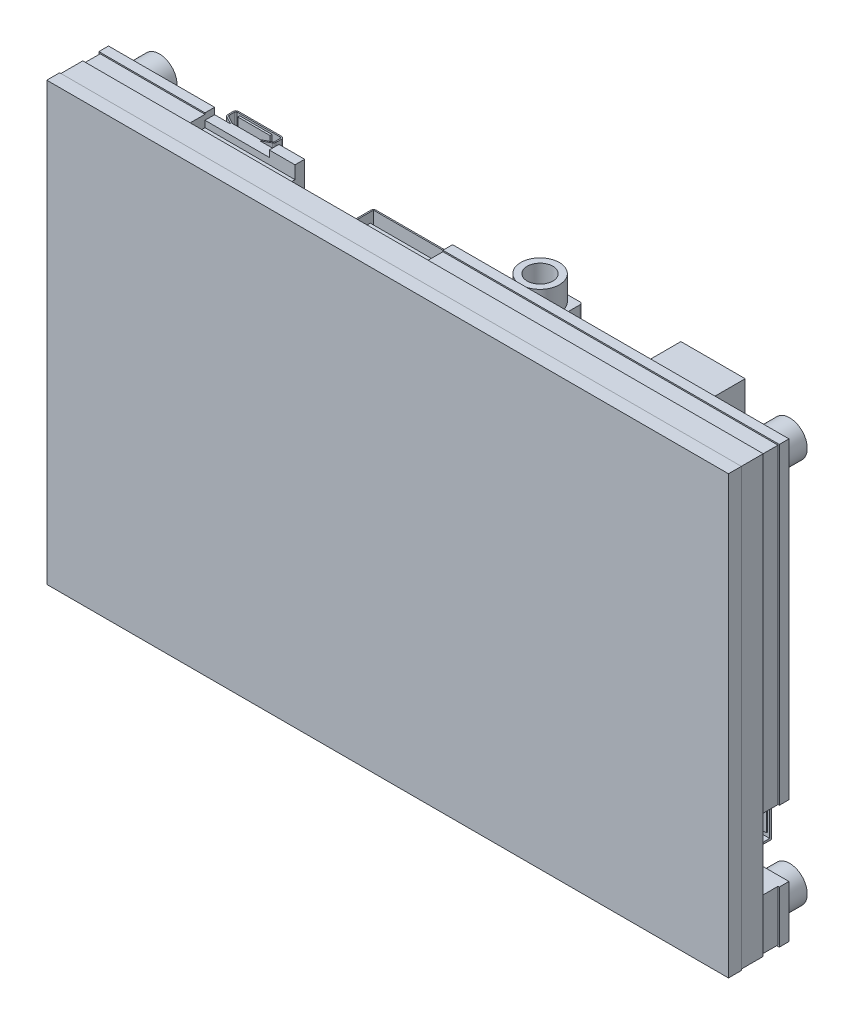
from build123d import *

# Parameters (mm, degrees)
ESQUISSE1_W                = 106
ESQUISSE1_H                = 67.9
BOSS_EXTRU_1_DEPTH         = 2
ESQUISSE2_W                = 105.8
ESQUISSE2_H                = 67.7
BOSS_EXTRU_2_DEPTH         = 3.5
ESQUISSE5_W                = 105.4
ESQUISSE5_H                = 67.3
BOSS_EXTRU_3_DEPTH         = 2.5
BOSS_EXTRU_4_DEPTH         = 1.5
ESQUISSE7_W                = 5.3
ESQUISSE7_H                = 11
ENL_V_MAT_EXTRU_1_DEPTH    = 2.5
ESQUISSE8_R                = 2.75
ESQUISSE8_R_2              = 1.25
BOSS_EXTRU_5_DEPTH         = 4
ESQUISSE9_W                = 10
ESQUISSE9_H                = 5
ESQUISSE9_W_2              = 9.4
ESQUISSE9_H_2              = 4.4
ESQUISSE9_W_3              = 7
ESQUISSE9_H_3              = 12.5
ESQUISSE9_W_4              = 15
ESQUISSE9_H_4              = 11.5
BOSS_EXTRU_6_DEPTH         = 6.2
CONG_1_R                   = 0.4
ESQUISSE10_R               = 3
ESQUISSE10_R_2             = 2
BOSS_EXTRU_7_DEPTH         = 3.8
ESQUISSE11_W               = 11.6
ESQUISSE11_H               = 1
ENL_V_MAT_EXTRU_2_DEPTH    = 7
ESQUISSE12_W               = 3
ESQUISSE12_H               = 7
BOSS_EXTRU_8_DEPTH         = 3.5
R_P_TITION_LIN_AIRE1_COUNT = 5
R_P_TITION_LIN_AIRE1_PITCH = 11.7
BOSS_EXTRU_9_DEPTH         = 5.5
CONG_2_R                   = 0.4
ESQUISSE15_W               = 5
ESQUISSE15_H               = 0.3
ENL_V_MAT_EXTRU_3_DEPTH    = 4
BOSS_EXTRU_10_DEPTH        = 0.5
BOSS_EXTRU_10_DEPTH_BACK   = 5
ESQUISSE17_W               = 0.2
ESQUISSE17_H               = 5
ENL_V_MAT_EXTRU_4_DEPTH    = 4


with BuildPart() as part:
    # Esquisse1 → Boss.-Extru.1 (new body)
    with BuildSketch(Plane.XY):
        Rectangle(ESQUISSE1_W, ESQUISSE1_H)
    extrude(amount=BOSS_EXTRU_1_DEPTH)

    # Esquisse2 → Boss.-Extru.2 (add)
    with BuildSketch(Plane(origin=(0, 0, 0), x_dir=(-1, 0, 0), z_dir=(0, 0, -1))):
        Rectangle(ESQUISSE2_W, ESQUISSE2_H)
    extrude(amount=BOSS_EXTRU_2_DEPTH)

    # Esquisse5 → Boss.-Extru.3 (add)
    with BuildSketch(Plane(origin=(0, 0, -3.5), x_dir=(-1, 0, 0), z_dir=(0, 0, -1))):
        Rectangle(ESQUISSE5_W, ESQUISSE5_H)
    extrude(amount=BOSS_EXTRU_3_DEPTH)

    # Esquisse6 → Boss.-Extru.4 (add)
    with BuildSketch(Plane(origin=(0, 0, -6), x_dir=(-1, 0, 0), z_dir=(0, 0, -1))):
        Polygon((-0.6, 33.85), (-52.9, 33.85), (-52.9, -14.75), (-47.4, -14.75), (-47.4, -25.75), (-52.9, -25.75), (-52.9, -33.85), (52.9, -33.85), (52.9, 33.85), (36.4, 33.85), (36.4, 32.85), (26.4, 32.85), (26.4, 33.85), (22.4, 33.85), (22.4, 25.85), (-0.6, 25.85), align=None)
    extrude(amount=BOSS_EXTRU_4_DEPTH)

    # Esquisse7 → Enl_v. mat.-Extru.1 (cut)
    with BuildSketch(Plane(origin=(0, 0, -6), x_dir=(-1, 0, 0), z_dir=(0, 0, -1))):
        with Locations((-50.05, -20.25)):
            Rectangle(ESQUISSE7_W, ESQUISSE7_H)
        Polygon((-0.6, 33.65), (-0.6, 25.85), (22.4, 25.85), (22.4, 31.85), (36.4, 31.85), (36.4, 33.65), align=None)
    extrude(amount=-ENL_V_MAT_EXTRU_1_DEPTH, mode=Mode.SUBTRACT)

    # Esquisse8 → Boss.-Extru.5 (add)
    # profile 1 of 8: a face of its own
    with BuildSketch(Plane(origin=(0, 0, -7.5), x_dir=(-1, 0, 0), z_dir=(0, 0, -1))):
        with Locations((-49, 30)):
            Circle(ESQUISSE8_R)
        with Locations((-49, 30)):
            Circle(ESQUISSE8_R_2, mode=Mode.SUBTRACT)
    # profile 2 of 8: a face of its own
    with BuildSketch(Plane(origin=(0, 0, -7.5), x_dir=(-1, 0, 0), z_dir=(0, 0, -1))):
        with Locations((49, 30)):
            Circle(ESQUISSE8_R)
        with Locations((49, 30)):
            Circle(ESQUISSE8_R_2, mode=Mode.SUBTRACT)
    # profile 3 of 8: a face of its own
    with BuildSketch(Plane(origin=(0, 0, -7.5), x_dir=(-1, 0, 0), z_dir=(0, 0, -1))):
        with Locations((38.8, 22.9)):
            Circle(ESQUISSE8_R)
        with Locations((38.8, 22.9)):
            Circle(ESQUISSE8_R_2, mode=Mode.SUBTRACT)
    # profile 4 of 8: a face of its own
    with BuildSketch(Plane(origin=(0, 0, -7.5), x_dir=(-1, 0, 0), z_dir=(0, 0, -1))):
        with Locations((-19.2, 22.9)):
            Circle(ESQUISSE8_R)
        with Locations((-19.2, 22.9)):
            Circle(ESQUISSE8_R_2, mode=Mode.SUBTRACT)
    # profile 5 of 8: a face of its own
    with BuildSketch(Plane(origin=(0, 0, -7.5), x_dir=(-1, 0, 0), z_dir=(0, 0, -1))):
        with Locations((-49, -30)):
            Circle(ESQUISSE8_R)
        with Locations((-49, -30)):
            Circle(ESQUISSE8_R_2, mode=Mode.SUBTRACT)
    # profile 6 of 8: a face of its own
    with BuildSketch(Plane(origin=(0, 0, -7.5), x_dir=(-1, 0, 0), z_dir=(0, 0, -1))):
        with Locations((-19.2, -27.1)):
            Circle(ESQUISSE8_R)
        with Locations((-19.2, -27.1)):
            Circle(ESQUISSE8_R_2, mode=Mode.SUBTRACT)
    # profile 7 of 8: a face of its own
    with BuildSketch(Plane(origin=(0, 0, -7.5), x_dir=(-1, 0, 0), z_dir=(0, 0, -1))):
        with Locations((38.8, -27.1)):
            Circle(ESQUISSE8_R)
        with Locations((38.8, -27.1)):
            Circle(ESQUISSE8_R_2, mode=Mode.SUBTRACT)
    # profile 8 of 8: a face of its own
    with BuildSketch(Plane(origin=(0, 0, -7.5), x_dir=(-1, 0, 0), z_dir=(0, 0, -1))):
        with Locations((49, -30)):
            Circle(ESQUISSE8_R)
        with Locations((49, -30)):
            Circle(ESQUISSE8_R_2, mode=Mode.SUBTRACT)
    extrude(amount=BOSS_EXTRU_5_DEPTH)

    # Esquisse9 → Boss.-Extru.6 (add)
    # profile 1 of 3: a face of its own
    with BuildSketch(Plane(origin=(0, 0, -7.5), x_dir=(-1, 0, 0), z_dir=(0, 0, -1))):
        with Locations((-34.9, 29.85)):
            Rectangle(ESQUISSE9_W, ESQUISSE9_H)
        with Locations((-34.9, 29.85)):
            Rectangle(ESQUISSE9_W_2, ESQUISSE9_H_2, mode=Mode.SUBTRACT)
    # profile 2 of 3: a face of its own
    with BuildSketch(Plane(origin=(0, 0, -7.5), x_dir=(-1, 0, 0), z_dir=(0, 0, -1))):
        with Locations((-11.1, 23.6)):
            Rectangle(ESQUISSE9_W_3, ESQUISSE9_H_3)
    # profile 3 of 3: a face of its own
    with BuildSketch(Plane(origin=(0, 0, -7.5), x_dir=(-1, 0, 0), z_dir=(0, 0, -1))):
        with Locations((10.4, 20.6)):
            Rectangle(ESQUISSE9_W_4, ESQUISSE9_H_4)
    extrude(amount=BOSS_EXTRU_6_DEPTH)

    # Cong_1
    cong_1_edges = [part.edges().sort_by_distance(p)[0] for p in [
        (14.6, 23.6, -13.7),
        (7.6, 23.6, -13.7),
        (-2.9, 20.6, -13.7),
        (-17.9, 20.6, -13.7),
    ]]
    fillet(cong_1_edges, radius=CONG_1_R)

    # Esquisse10 → Boss.-Extru.7 (add)
    with BuildSketch(Plane(origin=(0, 29.85, 0), x_dir=(1, 0, 0), z_dir=(0, 1, 0))):
        with Locations(Location((11.1, 10.6, 0), (0, 0, 90))):
            Circle(ESQUISSE10_R)
        with Locations(Location((11.1, 10.6, 0), (0, 0, 90))):
            Circle(ESQUISSE10_R_2, mode=Mode.SUBTRACT)
    extrude(amount=BOSS_EXTRU_7_DEPTH)

    # Esquisse11 → Enl_v. mat.-Extru.2 (cut)
    with BuildSketch(Plane(origin=(0, 26.35, 0), x_dir=(1, 0, 0), z_dir=(0, 1, 0))):
        Polygon((-17.7, 13.5), (-3.1, 13.5), (-3.1, 11), (-5.4, 7.8), (-15.4, 7.8), (-17.7, 11), align=None)
        with Locations((-10.4, 11)):
            Rectangle(ESQUISSE11_W, ESQUISSE11_H, mode=Mode.SUBTRACT)
    extrude(amount=-ENL_V_MAT_EXTRU_2_DEPTH, mode=Mode.SUBTRACT)

    # Esquisse12 → Boss.-Extru.8 (add)
    with BuildSketch(Plane(origin=(0, 0, -7.5), x_dir=(-1, 0, 0), z_dir=(0, 0, -1))):
        with Locations((49.4, 23.35)):
            Rectangle(ESQUISSE12_W, ESQUISSE12_H)
    boss_extru_8 = extrude(amount=BOSS_EXTRU_8_DEPTH)

    # R_p_tition lin_aire1: Boss.-Extru.8 ×5
    with Locations(*[(0, -i * R_P_TITION_LIN_AIRE1_PITCH, 0) for i in range(1, R_P_TITION_LIN_AIRE1_COUNT)]):
        add(boss_extru_8)

    # Esquisse13 → Boss.-Extru.9 (add)
    with BuildSketch(Plane(origin=(0, 32.85, 0), x_dir=(1, 0, 0), z_dir=(0, 1, 0))):
        Polygon((-35.4, 9.8), (-27.9, 9.8), (-27.9, 8.3), (-29.4, 7.5), (-33.9, 7.5), (-35.4, 8.3), align=None)
    extrude(amount=-BOSS_EXTRU_9_DEPTH)

    # Cong_2
    cong_2_edges = [part.edges().sort_by_distance(p)[0] for p in [
        (-35.4, 30.1, -8.3),
        (-35.4, 30.1, -9.8),
        (-27.9, 30.1, -9.8),
        (-27.9, 30.1, -8.3),
    ]]
    fillet(cong_2_edges, radius=CONG_2_R)

    # Esquisse15 → Enl_v. mat.-Extru.3 (cut)
    with BuildSketch(Plane(origin=(0, 32.85, 0), x_dir=(1, 0, 0), z_dir=(0, 1, 0))):
        with BuildLine():
            Line((-33.85, 7.7), (-29.45, 7.7))
            Line((-29.45, 7.7), (-28.205882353, 8.363529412))
            ThreePointArc((-28.205882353, 8.363529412), (-28.128501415, 8.437100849), (-28.1, 8.54))
            Line((-28.1, 8.54), (-28.1, 9.4))
            ThreePointArc((-28.1, 9.4), (-28.158578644, 9.541421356), (-28.3, 9.6))
            Line((-28.3, 9.6), (-35, 9.6))
            ThreePointArc((-35, 9.6), (-35.141421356, 9.541421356), (-35.2, 9.4))
            Line((-35.2, 9.4), (-35.2, 8.54))
            ThreePointArc((-35.2, 8.54), (-35.171498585, 8.437100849), (-35.094117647, 8.363529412))
            Line((-35.094117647, 8.363529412), (-33.85, 7.7))
        make_face()
        with Locations((-31.8, 9.15)):
            Rectangle(ESQUISSE15_W, ESQUISSE15_H, mode=Mode.SUBTRACT)
    extrude(amount=-ENL_V_MAT_EXTRU_3_DEPTH, mode=Mode.SUBTRACT)

    # Esquisse16 → Boss.-Extru.10 (add, two sides: drawn at the far end of the back side and taken through both)
    with BuildSketch(Plane(origin=(47.4, 0, 0), x_dir=(0, 0, -1), z_dir=(1, 0, 0)).offset(-BOSS_EXTRU_10_DEPTH_BACK)):
        Polygon((9.8, -16.25), (9.8, -23.75), (8.3, -23.75), (7.5, -22.25), (7.5, -17.75), (8.3, -16.25), align=None)
    extrude(amount=BOSS_EXTRU_10_DEPTH + BOSS_EXTRU_10_DEPTH_BACK)

    # Esquisse17 → Enl_v. mat.-Extru.4 (cut)
    with BuildSketch(Plane(origin=(47.9, 0, 0), x_dir=(0, 0, -1), z_dir=(1, 0, 0))):
        Polygon((9.5, -16.55), (8.48, -16.55), (7.8, -17.825), (7.8, -22.175), (8.48, -23.45), (9.5, -23.45), align=None)
        with Locations((9.1, -19.95)):
            Rectangle(ESQUISSE17_W, ESQUISSE17_H, mode=Mode.SUBTRACT)
    extrude(amount=-ENL_V_MAT_EXTRU_4_DEPTH, mode=Mode.SUBTRACT)


solid = part.part
